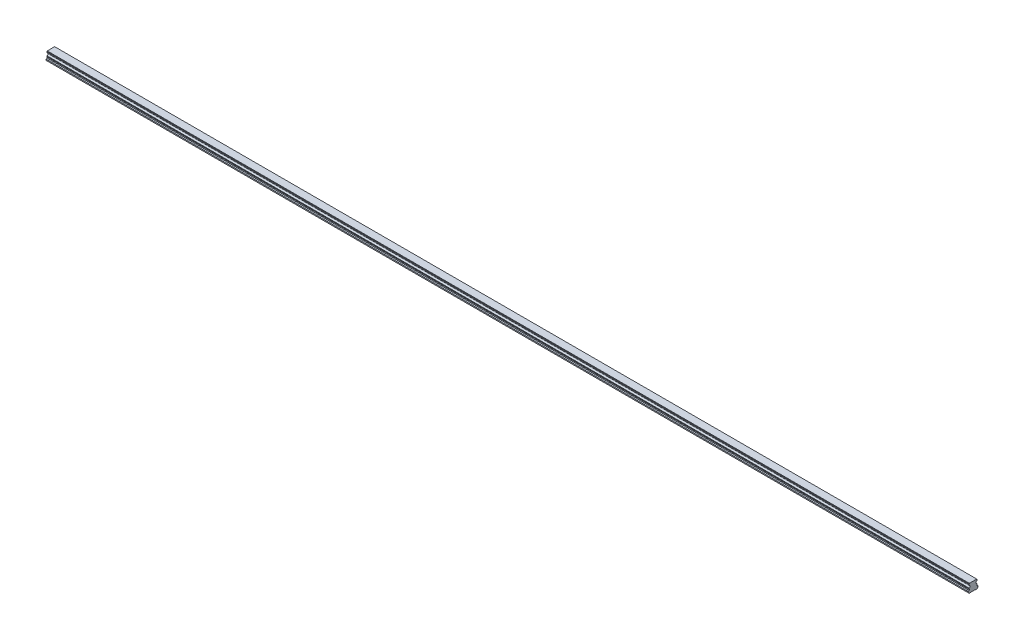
from build123d import *

# Parameters (mm, degrees)
BOSS_EXTRUDE1_DEPTH        = 2340
SKETCH3_R                  = 3
SKETCH3_R_2                = 2.5
CUT_EXTRUDE3_DEPTH         = 12
SKETCH3_2_R                = 2.5
CUT_EXTRUDE4_DEPTH         = 15
CHAMFER1_SIZE              = 0.5
LPATTERN4_COUNT            = 39
LPATTERN4_PITCH            = 60
CHAMFER1_OF_LPATTERN4_SIZE = 0.5


with BuildPart() as part:
    # Sketch1 → Boss-Extrude1 (new body)
    with BuildSketch(Plane(origin=(0, 0, 0), x_dir=(0, 0, -1), z_dir=(1, 0, 0))):
        with BuildLine():
            Line((9.375, 21.8), (-9.375, 21.8))
            Line((-9.375, 21.8), (-9.375, 20.756))
            Line((-9.375, 20.756), (-10, 19.415683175))
            Line((-10, 19.415683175), (-10, 17.685449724))
            ThreePointArc((-10, 17.685449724), (-7.2, 14.6), (-10, 11.514550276))
            Line((-10, 11.514550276), (-10, 9.784316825))
            Line((-10, 9.784316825), (-9.375, 8.444))
            Line((-9.375, 8.444), (-9.922688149, 6.4))
            Line((-9.922688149, 6.4), (-12.5, 5.489338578))
            Line((-12.5, 5.489338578), (-12.5, 2.65))
            Line((-12.5, 2.65), (-9.85, 0))
            Line((-9.85, 0), (-5.5, 0))
            Line((-5.5, 0), (-5, 0.5))
            Line((-5, 0.5), (5, 0.5))
            Line((5, 0.5), (5.5, 0))
            Line((5.5, 0), (9.85, 0))
            Line((9.85, 0), (12.5, 2.65))
            Line((12.5, 2.65), (12.5, 5.489338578))
            Line((12.5, 5.489338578), (9.922688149, 6.4))
            Line((9.922688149, 6.4), (9.375, 8.444))
            Line((9.375, 8.444), (10, 9.784316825))
            Line((10, 9.784316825), (10, 11.514550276))
            ThreePointArc((10, 11.514550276), (7.2, 14.6), (10, 17.685449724))
            Line((10, 17.685449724), (10, 19.415683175))
            Line((10, 19.415683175), (9.375, 20.756))
            Line((9.375, 20.756), (9.375, 21.8))
        make_face()
    extrude(amount=BOSS_EXTRUDE1_DEPTH)

    # Sketch3 → Cut-Extrude3 (cut)
    with BuildSketch(Plane.XZ):
        with Locations(Location((30, 0, 0), (0, 0, 270))):
            Circle(SKETCH3_R)
        with Locations(Location((30, 0, 0), (0, 0, 270))):
            Circle(SKETCH3_R_2, mode=Mode.SUBTRACT)
    cut_extrude3 = extrude(amount=-CUT_EXTRUDE3_DEPTH, mode=Mode.SUBTRACT)

    # Sketch3_2 → Cut-Extrude4 (cut)
    with BuildSketch(Plane.XZ):
        with Locations(Location((30, 0, 0), (0, 0, 270))):
            Circle(SKETCH3_2_R)
    cut_extrude4 = extrude(amount=-CUT_EXTRUDE4_DEPTH, mode=Mode.SUBTRACT)

    # Cut-Extrude5 cone 1 section (on through the dimple's axis) → Cut-Extrude5 (revolve, cut)
    with BuildSketch(Plane(origin=(30, 15, 0), x_dir=(0, 0, -1), z_dir=(1, 0, 0))):
        Polygon((0, 0), (2.5, 0), (0, 1.443375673), align=None)
    cut_extrude5 = revolve(axis=Axis((30, 15, 0), (0, 1, 0)), mode=Mode.SUBTRACT)

    # Chamfer1
    chamfer1_edges = [part.edges().sort_by_distance(p)[0] for p in [
        (30, 0.5, 3),
    ]]
    chamfer(chamfer1_edges, length=CHAMFER1_SIZE)

    # LPattern4: Cut-Extrude3, Cut-Extrude4, Cut-Extrude5 ×39
    with Locations(*[(i * LPATTERN4_PITCH, 0, 0) for i in range(1, LPATTERN4_COUNT)]):
        add(cut_extrude3, mode=Mode.SUBTRACT)
        add(cut_extrude4, mode=Mode.SUBTRACT)
        add(cut_extrude5, mode=Mode.SUBTRACT)

    # Chamfer1 of LPattern4
    chamfer1_of_lpattern4_edges = [part.edges().sort_by_distance(p)[0] for p in [
        (90, 0.5, 3),
        (150, 0.5, 3),
        (210, 0.5, 3),
        (270, 0.5, 3),
        (330, 0.5, 3),
        (390, 0.5, 3),
        (450, 0.5, 3),
        (510, 0.5, 3),
        (570, 0.5, 3),
        (630, 0.5, 3),
        (690, 0.5, 3),
        (750, 0.5, 3),
        (810, 0.5, 3),
        (870, 0.5, 3),
        (930, 0.5, 3),
        (990, 0.5, 3),
        (1050, 0.5, 3),
        (1110, 0.5, 3),
        (1170, 0.5, 3),
        (1230, 0.5, 3),
        (1290, 0.5, 3),
        (1350, 0.5, 3),
        (1410, 0.5, 3),
        (1470, 0.5, 3),
        (1530, 0.5, 3),
        (1590, 0.5, 3),
        (1650, 0.5, 3),
        (1710, 0.5, 3),
        (1770, 0.5, 3),
        (1830, 0.5, 3),
        (1890, 0.5, 3),
        (1950, 0.5, 3),
        (2010, 0.5, 3),
        (2070, 0.5, 3),
        (2130, 0.5, 3),
        (2190, 0.5, 3),
        (2250, 0.5, 3),
        (2310, 0.5, 3),
    ]]
    chamfer(chamfer1_of_lpattern4_edges, length=CHAMFER1_OF_LPATTERN4_SIZE)


solid = part.part
